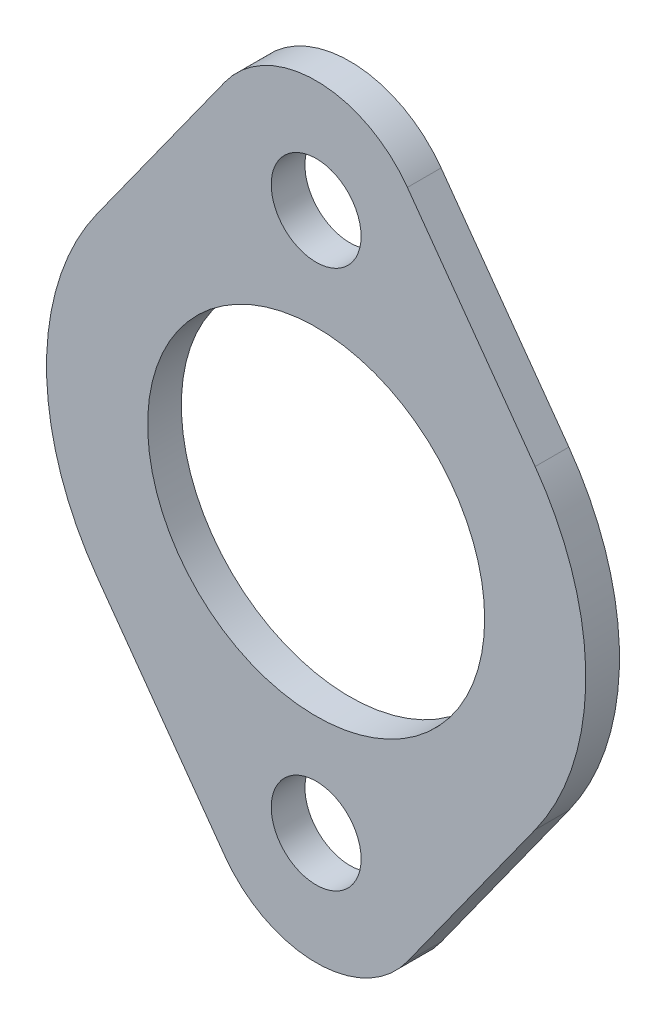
ISO-10303-21;
HEADER;
FILE_DESCRIPTION(('STEP AP214'),'2;1');
FILE_NAME('part.step','',(''),(''),'','','');
FILE_SCHEMA(('AUTOMOTIVE_DESIGN { 1 0 10303 214 1 1 1 1 }'));
ENDSEC;
DATA;
#1=APPLICATION_CONTEXT('core data for automotive mechanical design processes');
#2=APPLICATION_PROTOCOL_DEFINITION('international standard','automotive_design',2000,#1);
#3=PRODUCT_CONTEXT('',#1,'mechanical');
#4=PRODUCT('Part','Part','',(#3));
#5=PRODUCT_RELATED_PRODUCT_CATEGORY('part','',(#4));
#6=PRODUCT_DEFINITION_FORMATION('','',#4);
#7=PRODUCT_DEFINITION_CONTEXT('part definition',#1,'design');
#8=PRODUCT_DEFINITION('design','',#6,#7);
#9=PRODUCT_DEFINITION_SHAPE('','',#8);
#10=(LENGTH_UNIT() NAMED_UNIT(*) SI_UNIT(.MILLI.,.METRE.));
#11=(NAMED_UNIT(*) PLANE_ANGLE_UNIT() SI_UNIT($,.RADIAN.));
#12=(NAMED_UNIT(*) SI_UNIT($,.STERADIAN.) SOLID_ANGLE_UNIT());
#13=UNCERTAINTY_MEASURE_WITH_UNIT(LENGTH_MEASURE(1.E-05),#10,'distance_accuracy_value','');
#14=(GEOMETRIC_REPRESENTATION_CONTEXT(3) GLOBAL_UNCERTAINTY_ASSIGNED_CONTEXT((#13)) GLOBAL_UNIT_ASSIGNED_CONTEXT((#10,
#11,#12)) REPRESENTATION_CONTEXT('',''));
#15=CARTESIAN_POINT('',(0.,0.,0.));
#16=DIRECTION('',(0.,0.,1.));
#17=DIRECTION('',(1.,0.,0.));
#18=AXIS2_PLACEMENT_3D('',#15,#16,#17);
#19=CARTESIAN_POINT('',(0.,38.1,4.7625));
#20=DIRECTION('',(0.,0.,-1.));
#21=DIRECTION('',(-1.,0.,0.));
#22=AXIS2_PLACEMENT_3D('',#19,#20,#21);
#23=CYLINDRICAL_SURFACE('',#22,15.875);
#24=CARTESIAN_POINT('',(0.,38.1,0.));
#25=DIRECTION('',(0.,0.,-1.));
#26=DIRECTION('',(-1.,0.,0.));
#27=AXIS2_PLACEMENT_3D('',#24,#25,#26);
#28=CIRCLE('',#27,15.875);
#29=CARTESIAN_POINT('',(-12.8941966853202,47.3604166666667,0.));
#30=VERTEX_POINT('',#29);
#31=CARTESIAN_POINT('',(12.8941966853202,47.3604166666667,0.));
#32=VERTEX_POINT('',#31);
#33=EDGE_CURVE('E95',#30,#32,#28,.T.);
#34=ORIENTED_EDGE('',*,*,#33,.F.);
#35=DIRECTION('',(0.,0.,-1.));
#36=VECTOR('',#35,1.);
#37=CARTESIAN_POINT('',(-12.8941966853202,47.3604166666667,4.7625));
#38=LINE('',#37,#36);
#39=CARTESIAN_POINT('',(-12.8941966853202,47.3604166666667,4.7625));
#40=VERTEX_POINT('',#39);
#41=EDGE_CURVE('E11',#40,#30,#38,.T.);
#42=ORIENTED_EDGE('',*,*,#41,.F.);
#43=CARTESIAN_POINT('',(0.,38.1,4.7625));
#44=DIRECTION('',(0.,0.,-1.));
#45=DIRECTION('',(-1.,0.,0.));
#46=AXIS2_PLACEMENT_3D('',#43,#44,#45);
#47=CIRCLE('',#46,15.875);
#48=CARTESIAN_POINT('',(12.8941966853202,47.3604166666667,4.7625));
#49=VERTEX_POINT('',#48);
#50=EDGE_CURVE('E96',#40,#49,#47,.T.);
#51=ORIENTED_EDGE('',*,*,#50,.T.);
#52=DIRECTION('',(0.,0.,-1.));
#53=VECTOR('',#52,1.);
#54=CARTESIAN_POINT('',(12.8941966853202,47.3604166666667,4.7625));
#55=LINE('',#54,#53);
#56=EDGE_CURVE('E33',#49,#32,#55,.T.);
#57=ORIENTED_EDGE('',*,*,#56,.T.);
#58=EDGE_LOOP('',(#34,#42,#51,#57));
#59=FACE_BOUND('',#58,.T.);
#60=ADVANCED_FACE('F30',(#59),#23,.T.);
#61=CARTESIAN_POINT('',(-12.8941966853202,47.3604166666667,4.7625));
#62=DIRECTION('',(0.812232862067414,-0.583333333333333,0.));
#63=DIRECTION('',(0.583333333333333,0.812232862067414,0.));
#64=AXIS2_PLACEMENT_3D('',#61,#62,#63);
#65=PLANE('',#64);
#66=DIRECTION('',(-0.583333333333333,-0.812232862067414,0.));
#67=VECTOR('',#66,1.);
#68=CARTESIAN_POINT('',(-12.8941966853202,47.3604166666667,0.));
#69=LINE('',#68,#67);
#70=CARTESIAN_POINT('',(-30.9460720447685,22.225,0.));
#71=VERTEX_POINT('',#70);
#72=EDGE_CURVE('E113',#30,#71,#69,.T.);
#73=ORIENTED_EDGE('',*,*,#72,.T.);
#74=DIRECTION('',(0.,0.,-1.));
#75=VECTOR('',#74,1.);
#76=CARTESIAN_POINT('',(-30.9460720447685,22.225,4.7625));
#77=LINE('',#76,#75);
#78=CARTESIAN_POINT('',(-30.9460720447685,22.225,4.7625));
#79=VERTEX_POINT('',#78);
#80=EDGE_CURVE('E38',#79,#71,#77,.T.);
#81=ORIENTED_EDGE('',*,*,#80,.F.);
#82=DIRECTION('',(-0.583333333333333,-0.812232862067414,0.));
#83=VECTOR('',#82,1.);
#84=CARTESIAN_POINT('',(-12.8941966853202,47.3604166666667,4.7625));
#85=LINE('',#84,#83);
#86=EDGE_CURVE('E51',#40,#79,#85,.T.);
#87=ORIENTED_EDGE('',*,*,#86,.F.);
#88=ORIENTED_EDGE('',*,*,#41,.T.);
#89=EDGE_LOOP('',(#73,#81,#87,#88));
#90=FACE_BOUND('',#89,.T.);
#91=ADVANCED_FACE('F179',(#90),#65,.F.);
#92=CARTESIAN_POINT('',(0.,0.,4.7625));
#93=DIRECTION('',(0.,0.,-1.));
#94=DIRECTION('',(-1.,0.,0.));
#95=AXIS2_PLACEMENT_3D('',#92,#93,#94);
#96=CYLINDRICAL_SURFACE('',#95,38.1);
#97=CARTESIAN_POINT('',(0.,0.,0.));
#98=DIRECTION('',(0.,0.,-1.));
#99=DIRECTION('',(-1.,0.,0.));
#100=AXIS2_PLACEMENT_3D('',#97,#98,#99);
#101=CIRCLE('',#100,38.1);
#102=CARTESIAN_POINT('',(-30.9460720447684,-22.225,0.));
#103=VERTEX_POINT('',#102);
#104=EDGE_CURVE('E130',#103,#71,#101,.T.);
#105=ORIENTED_EDGE('',*,*,#104,.F.);
#106=DIRECTION('',(0.,0.,-1.));
#107=VECTOR('',#106,1.);
#108=CARTESIAN_POINT('',(-30.9460720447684,-22.225,4.7625));
#109=LINE('',#108,#107);
#110=CARTESIAN_POINT('',(-30.9460720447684,-22.225,4.7625));
#111=VERTEX_POINT('',#110);
#112=EDGE_CURVE('E151',#111,#103,#109,.T.);
#113=ORIENTED_EDGE('',*,*,#112,.F.);
#114=CARTESIAN_POINT('',(0.,0.,4.7625));
#115=DIRECTION('',(0.,0.,-1.));
#116=DIRECTION('',(-1.,0.,0.));
#117=AXIS2_PLACEMENT_3D('',#114,#115,#116);
#118=CIRCLE('',#117,38.1);
#119=EDGE_CURVE('E146',#111,#79,#118,.T.);
#120=ORIENTED_EDGE('',*,*,#119,.T.);
#121=ORIENTED_EDGE('',*,*,#80,.T.);
#122=EDGE_LOOP('',(#105,#113,#120,#121));
#123=FACE_BOUND('',#122,.T.);
#124=ADVANCED_FACE('F177',(#123),#96,.T.);
#125=CARTESIAN_POINT('',(-12.8941966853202,-47.3604166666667,4.7625));
#126=DIRECTION('',(-0.812232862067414,-0.583333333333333,0.));
#127=DIRECTION('',(0.583333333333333,-0.812232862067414,0.));
#128=AXIS2_PLACEMENT_3D('',#125,#126,#127);
#129=PLANE('',#128);
#130=DIRECTION('',(-0.583333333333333,0.812232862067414,0.));
#131=VECTOR('',#130,1.);
#132=CARTESIAN_POINT('',(-12.8941966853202,-47.3604166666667,0.));
#133=LINE('',#132,#131);
#134=CARTESIAN_POINT('',(-12.8941966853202,-47.3604166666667,0.));
#135=VERTEX_POINT('',#134);
#136=EDGE_CURVE('E127',#135,#103,#133,.T.);
#137=ORIENTED_EDGE('',*,*,#136,.F.);
#138=DIRECTION('',(0.,0.,-1.));
#139=VECTOR('',#138,1.);
#140=CARTESIAN_POINT('',(-12.8941966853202,-47.3604166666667,4.7625));
#141=LINE('',#140,#139);
#142=CARTESIAN_POINT('',(-12.8941966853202,-47.3604166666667,4.7625));
#143=VERTEX_POINT('',#142);
#144=EDGE_CURVE('E153',#143,#135,#141,.T.);
#145=ORIENTED_EDGE('',*,*,#144,.F.);
#146=DIRECTION('',(-0.583333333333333,0.812232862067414,0.));
#147=VECTOR('',#146,1.);
#148=CARTESIAN_POINT('',(-12.8941966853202,-47.3604166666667,4.7625));
#149=LINE('',#148,#147);
#150=EDGE_CURVE('E143',#143,#111,#149,.T.);
#151=ORIENTED_EDGE('',*,*,#150,.T.);
#152=ORIENTED_EDGE('',*,*,#112,.T.);
#153=EDGE_LOOP('',(#137,#145,#151,#152));
#154=FACE_BOUND('',#153,.T.);
#155=ADVANCED_FACE('F172',(#154),#129,.T.);
#156=CARTESIAN_POINT('',(0.,-38.1,4.7625));
#157=DIRECTION('',(0.,0.,-1.));
#158=DIRECTION('',(-1.,0.,0.));
#159=AXIS2_PLACEMENT_3D('',#156,#157,#158);
#160=CYLINDRICAL_SURFACE('',#159,15.875);
#161=CARTESIAN_POINT('',(0.,-38.1,0.));
#162=DIRECTION('',(0.,0.,1.));
#163=DIRECTION('',(1.,0.,0.));
#164=AXIS2_PLACEMENT_3D('',#161,#162,#163);
#165=CIRCLE('',#164,15.875);
#166=CARTESIAN_POINT('',(12.8941966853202,-47.3604166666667,0.));
#167=VERTEX_POINT('',#166);
#168=EDGE_CURVE('E125',#135,#167,#165,.T.);
#169=ORIENTED_EDGE('',*,*,#168,.T.);
#170=DIRECTION('',(0.,0.,-1.));
#171=VECTOR('',#170,1.);
#172=CARTESIAN_POINT('',(12.8941966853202,-47.3604166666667,4.7625));
#173=LINE('',#172,#171);
#174=CARTESIAN_POINT('',(12.8941966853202,-47.3604166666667,4.7625));
#175=VERTEX_POINT('',#174);
#176=EDGE_CURVE('E155',#175,#167,#173,.T.);
#177=ORIENTED_EDGE('',*,*,#176,.F.);
#178=CARTESIAN_POINT('',(0.,-38.1,4.7625));
#179=DIRECTION('',(0.,0.,1.));
#180=DIRECTION('',(1.,0.,0.));
#181=AXIS2_PLACEMENT_3D('',#178,#179,#180);
#182=CIRCLE('',#181,15.875);
#183=EDGE_CURVE('E141',#143,#175,#182,.T.);
#184=ORIENTED_EDGE('',*,*,#183,.F.);
#185=ORIENTED_EDGE('',*,*,#144,.T.);
#186=EDGE_LOOP('',(#169,#177,#184,#185));
#187=FACE_BOUND('',#186,.T.);
#188=ADVANCED_FACE('F181',(#187),#160,.T.);
#189=CARTESIAN_POINT('',(12.8941966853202,-47.3604166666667,4.7625));
#190=DIRECTION('',(-0.812232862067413,0.583333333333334,0.));
#191=DIRECTION('',(-0.583333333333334,-0.812232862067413,0.));
#192=AXIS2_PLACEMENT_3D('',#189,#190,#191);
#193=PLANE('',#192);
#194=DIRECTION('',(0.583333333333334,0.812232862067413,0.));
#195=VECTOR('',#194,1.);
#196=CARTESIAN_POINT('',(12.8941966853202,-47.3604166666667,0.));
#197=LINE('',#196,#195);
#198=CARTESIAN_POINT('',(30.9460720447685,-22.225,0.));
#199=VERTEX_POINT('',#198);
#200=EDGE_CURVE('E122',#167,#199,#197,.T.);
#201=ORIENTED_EDGE('',*,*,#200,.T.);
#202=DIRECTION('',(0.,0.,-1.));
#203=VECTOR('',#202,1.);
#204=CARTESIAN_POINT('',(30.9460720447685,-22.225,4.7625));
#205=LINE('',#204,#203);
#206=CARTESIAN_POINT('',(30.9460720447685,-22.225,4.7625));
#207=VERTEX_POINT('',#206);
#208=EDGE_CURVE('E158',#207,#199,#205,.T.);
#209=ORIENTED_EDGE('',*,*,#208,.F.);
#210=DIRECTION('',(0.583333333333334,0.812232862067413,0.));
#211=VECTOR('',#210,1.);
#212=CARTESIAN_POINT('',(12.8941966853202,-47.3604166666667,4.7625));
#213=LINE('',#212,#211);
#214=EDGE_CURVE('E139',#175,#207,#213,.T.);
#215=ORIENTED_EDGE('',*,*,#214,.F.);
#216=ORIENTED_EDGE('',*,*,#176,.T.);
#217=EDGE_LOOP('',(#201,#209,#215,#216));
#218=FACE_BOUND('',#217,.T.);
#219=ADVANCED_FACE('F166',(#218),#193,.F.);
#220=CARTESIAN_POINT('',(0.,0.,4.7625));
#221=DIRECTION('',(0.,0.,-1.));
#222=DIRECTION('',(-1.,0.,0.));
#223=AXIS2_PLACEMENT_3D('',#220,#221,#222);
#224=CYLINDRICAL_SURFACE('',#223,38.1);
#225=CARTESIAN_POINT('',(0.,0.,0.));
#226=DIRECTION('',(0.,0.,-1.));
#227=DIRECTION('',(-1.,0.,0.));
#228=AXIS2_PLACEMENT_3D('',#225,#226,#227);
#229=CIRCLE('',#228,38.1);
#230=CARTESIAN_POINT('',(30.9460720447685,22.225,0.));
#231=VERTEX_POINT('',#230);
#232=EDGE_CURVE('E107',#231,#199,#229,.T.);
#233=ORIENTED_EDGE('',*,*,#232,.F.);
#234=DIRECTION('',(0.,0.,-1.));
#235=VECTOR('',#234,1.);
#236=CARTESIAN_POINT('',(30.9460720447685,22.225,4.7625));
#237=LINE('',#236,#235);
#238=CARTESIAN_POINT('',(30.9460720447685,22.225,4.7625));
#239=VERTEX_POINT('',#238);
#240=EDGE_CURVE('E100',#239,#231,#237,.T.);
#241=ORIENTED_EDGE('',*,*,#240,.F.);
#242=CARTESIAN_POINT('',(0.,0.,4.7625));
#243=DIRECTION('',(0.,0.,-1.));
#244=DIRECTION('',(-1.,0.,0.));
#245=AXIS2_PLACEMENT_3D('',#242,#243,#244);
#246=CIRCLE('',#245,38.1);
#247=EDGE_CURVE('E136',#239,#207,#246,.T.);
#248=ORIENTED_EDGE('',*,*,#247,.T.);
#249=ORIENTED_EDGE('',*,*,#208,.T.);
#250=EDGE_LOOP('',(#233,#241,#248,#249));
#251=FACE_BOUND('',#250,.T.);
#252=ADVANCED_FACE('F161',(#251),#224,.T.);
#253=CARTESIAN_POINT('',(12.8941966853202,47.3604166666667,4.7625));
#254=DIRECTION('',(0.812232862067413,0.583333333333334,0.));
#255=DIRECTION('',(-0.583333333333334,0.812232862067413,0.));
#256=AXIS2_PLACEMENT_3D('',#253,#254,#255);
#257=PLANE('',#256);
#258=DIRECTION('',(0.583333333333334,-0.812232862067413,0.));
#259=VECTOR('',#258,1.);
#260=CARTESIAN_POINT('',(12.8941966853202,47.3604166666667,0.));
#261=LINE('',#260,#259);
#262=EDGE_CURVE('E102',#32,#231,#261,.T.);
#263=ORIENTED_EDGE('',*,*,#262,.F.);
#264=ORIENTED_EDGE('',*,*,#56,.F.);
#265=DIRECTION('',(0.583333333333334,-0.812232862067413,0.));
#266=VECTOR('',#265,1.);
#267=CARTESIAN_POINT('',(12.8941966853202,47.3604166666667,4.7625));
#268=LINE('',#267,#266);
#269=EDGE_CURVE('E134',#49,#239,#268,.T.);
#270=ORIENTED_EDGE('',*,*,#269,.T.);
#271=ORIENTED_EDGE('',*,*,#240,.T.);
#272=EDGE_LOOP('',(#263,#264,#270,#271));
#273=FACE_BOUND('',#272,.T.);
#274=ADVANCED_FACE('F103',(#273),#257,.T.);
#275=CARTESIAN_POINT('',(0.,38.1,4.7625));
#276=DIRECTION('',(0.,0.,-1.));
#277=DIRECTION('',(-1.,0.,0.));
#278=AXIS2_PLACEMENT_3D('',#275,#276,#277);
#279=PLANE('',#278);
#280=CARTESIAN_POINT('',(0.,0.,4.7625));
#281=DIRECTION('',(0.,0.,1.));
#282=DIRECTION('',(1.,0.,0.));
#283=AXIS2_PLACEMENT_3D('',#280,#281,#282);
#284=CIRCLE('',#283,23.8125);
#285=CARTESIAN_POINT('',(23.8125,0.,4.7625));
#286=VERTEX_POINT('',#285);
#287=EDGE_CURVE('E225',#286,#286,#284,.T.);
#288=ORIENTED_EDGE('',*,*,#287,.F.);
#289=EDGE_LOOP('',(#288));
#290=FACE_BOUND('',#289,.T.);
#291=CARTESIAN_POINT('',(0.,-38.1,4.7625));
#292=DIRECTION('',(0.,0.,1.));
#293=DIRECTION('',(1.,0.,0.));
#294=AXIS2_PLACEMENT_3D('',#291,#292,#293);
#295=CIRCLE('',#294,6.35);
#296=CARTESIAN_POINT('',(6.35,-38.1,4.7625));
#297=VERTEX_POINT('',#296);
#298=EDGE_CURVE('E227',#297,#297,#295,.T.);
#299=ORIENTED_EDGE('',*,*,#298,.F.);
#300=EDGE_LOOP('',(#299));
#301=FACE_BOUND('',#300,.T.);
#302=CARTESIAN_POINT('',(0.,38.1,4.7625));
#303=DIRECTION('',(0.,0.,1.));
#304=DIRECTION('',(1.,0.,0.));
#305=AXIS2_PLACEMENT_3D('',#302,#303,#304);
#306=CIRCLE('',#305,6.35);
#307=CARTESIAN_POINT('',(6.35,38.1,4.7625));
#308=VERTEX_POINT('',#307);
#309=EDGE_CURVE('E117',#308,#308,#306,.T.);
#310=ORIENTED_EDGE('',*,*,#309,.F.);
#311=EDGE_LOOP('',(#310));
#312=FACE_BOUND('',#311,.T.);
#313=ORIENTED_EDGE('',*,*,#50,.F.);
#314=ORIENTED_EDGE('',*,*,#86,.T.);
#315=ORIENTED_EDGE('',*,*,#119,.F.);
#316=ORIENTED_EDGE('',*,*,#150,.F.);
#317=ORIENTED_EDGE('',*,*,#183,.T.);
#318=ORIENTED_EDGE('',*,*,#214,.T.);
#319=ORIENTED_EDGE('',*,*,#247,.F.);
#320=ORIENTED_EDGE('',*,*,#269,.F.);
#321=EDGE_LOOP('',(#313,#314,#315,#316,#317,#318,#319,#320));
#322=FACE_BOUND('',#321,.T.);
#323=ADVANCED_FACE('F180',(#290,#301,#312,#322),#279,.F.);
#324=CARTESIAN_POINT('',(0.,38.1,0.));
#325=DIRECTION('',(0.,0.,-1.));
#326=DIRECTION('',(-1.,0.,0.));
#327=AXIS2_PLACEMENT_3D('',#324,#325,#326);
#328=PLANE('',#327);
#329=CARTESIAN_POINT('',(0.,0.,0.));
#330=DIRECTION('',(0.,0.,1.));
#331=DIRECTION('',(1.,0.,0.));
#332=AXIS2_PLACEMENT_3D('',#329,#330,#331);
#333=CIRCLE('',#332,23.8125);
#334=CARTESIAN_POINT('',(23.8125,0.,0.));
#335=VERTEX_POINT('',#334);
#336=EDGE_CURVE('E222',#335,#335,#333,.T.);
#337=ORIENTED_EDGE('',*,*,#336,.T.);
#338=EDGE_LOOP('',(#337));
#339=FACE_BOUND('',#338,.T.);
#340=CARTESIAN_POINT('',(0.,-38.1,0.));
#341=DIRECTION('',(0.,0.,1.));
#342=DIRECTION('',(1.,0.,0.));
#343=AXIS2_PLACEMENT_3D('',#340,#341,#342);
#344=CIRCLE('',#343,6.35);
#345=CARTESIAN_POINT('',(6.35,-38.1,0.));
#346=VERTEX_POINT('',#345);
#347=EDGE_CURVE('E232',#346,#346,#344,.T.);
#348=ORIENTED_EDGE('',*,*,#347,.T.);
#349=EDGE_LOOP('',(#348));
#350=FACE_BOUND('',#349,.T.);
#351=CARTESIAN_POINT('',(0.,38.1,0.));
#352=DIRECTION('',(0.,0.,1.));
#353=DIRECTION('',(1.,0.,0.));
#354=AXIS2_PLACEMENT_3D('',#351,#352,#353);
#355=CIRCLE('',#354,6.35);
#356=CARTESIAN_POINT('',(6.35,38.1,0.));
#357=VERTEX_POINT('',#356);
#358=EDGE_CURVE('E114',#357,#357,#355,.T.);
#359=ORIENTED_EDGE('',*,*,#358,.T.);
#360=EDGE_LOOP('',(#359));
#361=FACE_BOUND('',#360,.T.);
#362=ORIENTED_EDGE('',*,*,#33,.T.);
#363=ORIENTED_EDGE('',*,*,#262,.T.);
#364=ORIENTED_EDGE('',*,*,#232,.T.);
#365=ORIENTED_EDGE('',*,*,#200,.F.);
#366=ORIENTED_EDGE('',*,*,#168,.F.);
#367=ORIENTED_EDGE('',*,*,#136,.T.);
#368=ORIENTED_EDGE('',*,*,#104,.T.);
#369=ORIENTED_EDGE('',*,*,#72,.F.);
#370=EDGE_LOOP('',(#362,#363,#364,#365,#366,#367,#368,#369));
#371=FACE_BOUND('',#370,.T.);
#372=ADVANCED_FACE('F110',(#339,#350,#361,#371),#328,.T.);
#373=CARTESIAN_POINT('',(0.,38.1,0.));
#374=DIRECTION('',(0.,0.,1.));
#375=DIRECTION('',(1.,0.,0.));
#376=AXIS2_PLACEMENT_3D('',#373,#374,#375);
#377=CYLINDRICAL_SURFACE('',#376,6.35);
#378=CARTESIAN_POINT('',(6.35,38.1,0.));
#379=CARTESIAN_POINT('',(6.35,38.1,0.049609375));
#380=CARTESIAN_POINT('',(6.35,38.1,0.09921875));
#381=CARTESIAN_POINT('',(6.35,38.1,0.1984375));
#382=CARTESIAN_POINT('',(6.35,38.1,0.248046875));
#383=CARTESIAN_POINT('',(6.35,38.1,0.347265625));
#384=CARTESIAN_POINT('',(6.35,38.1,0.396875));
#385=CARTESIAN_POINT('',(6.35,38.1,0.49609375));
#386=CARTESIAN_POINT('',(6.35,38.1,0.545703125));
#387=CARTESIAN_POINT('',(6.35,38.1,0.644921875));
#388=CARTESIAN_POINT('',(6.35,38.1,0.69453125));
#389=CARTESIAN_POINT('',(6.35,38.1,0.79375));
#390=CARTESIAN_POINT('',(6.35,38.1,0.843359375));
#391=CARTESIAN_POINT('',(6.35,38.1,0.942578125));
#392=CARTESIAN_POINT('',(6.35,38.1,0.9921875));
#393=CARTESIAN_POINT('',(6.35,38.1,1.09140625));
#394=CARTESIAN_POINT('',(6.35,38.1,1.141015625));
#395=CARTESIAN_POINT('',(6.35,38.1,1.240234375));
#396=CARTESIAN_POINT('',(6.35,38.1,1.28984375));
#397=CARTESIAN_POINT('',(6.35,38.1,1.3890625));
#398=CARTESIAN_POINT('',(6.35,38.1,1.438671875));
#399=CARTESIAN_POINT('',(6.35,38.1,1.537890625));
#400=CARTESIAN_POINT('',(6.35,38.1,1.5875));
#401=CARTESIAN_POINT('',(6.35,38.1,1.68671875));
#402=CARTESIAN_POINT('',(6.35,38.1,1.736328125));
#403=CARTESIAN_POINT('',(6.35,38.1,1.835546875));
#404=CARTESIAN_POINT('',(6.35,38.1,1.88515625));
#405=CARTESIAN_POINT('',(6.35,38.1,1.984375));
#406=CARTESIAN_POINT('',(6.35,38.1,2.033984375));
#407=CARTESIAN_POINT('',(6.35,38.1,2.133203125));
#408=CARTESIAN_POINT('',(6.35,38.1,2.1828125));
#409=CARTESIAN_POINT('',(6.35,38.1,2.28203125));
#410=CARTESIAN_POINT('',(6.35,38.1,2.331640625));
#411=CARTESIAN_POINT('',(6.35,38.1,2.430859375));
#412=CARTESIAN_POINT('',(6.35,38.1,2.48046875));
#413=CARTESIAN_POINT('',(6.35,38.1,2.5796875));
#414=CARTESIAN_POINT('',(6.35,38.1,2.629296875));
#415=CARTESIAN_POINT('',(6.35,38.1,2.728515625));
#416=CARTESIAN_POINT('',(6.35,38.1,2.778125));
#417=CARTESIAN_POINT('',(6.35,38.1,2.87734375));
#418=CARTESIAN_POINT('',(6.35,38.1,2.926953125));
#419=CARTESIAN_POINT('',(6.35,38.1,3.026171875));
#420=CARTESIAN_POINT('',(6.35,38.1,3.07578125));
#421=CARTESIAN_POINT('',(6.35,38.1,3.175));
#422=CARTESIAN_POINT('',(6.35,38.1,3.224609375));
#423=CARTESIAN_POINT('',(6.35,38.1,3.323828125));
#424=CARTESIAN_POINT('',(6.35,38.1,3.3734375));
#425=CARTESIAN_POINT('',(6.35,38.1,3.47265625));
#426=CARTESIAN_POINT('',(6.35,38.1,3.522265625));
#427=CARTESIAN_POINT('',(6.35,38.1,3.621484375));
#428=CARTESIAN_POINT('',(6.35,38.1,3.67109375));
#429=CARTESIAN_POINT('',(6.35,38.1,3.7703125));
#430=CARTESIAN_POINT('',(6.35,38.1,3.819921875));
#431=CARTESIAN_POINT('',(6.35,38.1,3.919140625));
#432=CARTESIAN_POINT('',(6.35,38.1,3.96875));
#433=CARTESIAN_POINT('',(6.35,38.1,4.06796875));
#434=CARTESIAN_POINT('',(6.35,38.1,4.117578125));
#435=CARTESIAN_POINT('',(6.35,38.1,4.216796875));
#436=CARTESIAN_POINT('',(6.35,38.1,4.26640625));
#437=CARTESIAN_POINT('',(6.35,38.1,4.365625));
#438=CARTESIAN_POINT('',(6.35,38.1,4.415234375));
#439=CARTESIAN_POINT('',(6.35,38.1,4.514453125));
#440=CARTESIAN_POINT('',(6.35,38.1,4.5640625));
#441=CARTESIAN_POINT('',(6.35,38.1,4.66328125));
#442=CARTESIAN_POINT('',(6.35,38.1,4.712890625));
#443=CARTESIAN_POINT('',(6.35,38.1,4.7625));
#444=B_SPLINE_CURVE_WITH_KNOTS('',3,(#378,#379,#380,#381,#382,#383,#384,#385,#386,#387,#388,
#389,#390,#391,#392,#393,#394,#395,#396,#397,#398,#399,#400,#401,#402,#403,#404,#405,#406,#407,
#408,#409,#410,#411,#412,#413,#414,#415,#416,#417,#418,#419,#420,#421,#422,#423,#424,#425,#426,
#427,#428,#429,#430,#431,#432,#433,#434,#435,#436,#437,#438,#439,#440,#441,#442,#443),
.UNSPECIFIED.,.F.,.F.,(4,2,2,2,2,2,2,2,2,2,2,2,2,2,2,2,2,2,2,2,2,2,2,2,2,2,2,2,2,2,2,2,4),(0.,
0.148828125,0.29765625,0.446484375,0.5953125,0.744140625,0.89296875,1.041796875,1.190625,
1.339453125,1.48828125,1.637109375,1.7859375,1.934765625,2.08359375,2.232421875,2.38125,
2.530078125,2.67890625,2.827734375,2.9765625,3.125390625,3.27421875,3.423046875,3.571875,
3.720703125,3.86953125,4.018359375,4.1671875,4.316015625,4.46484375,4.613671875,4.7625),.UNSPECIFIED.);
#445=EDGE_CURVE('BSEAM205',#357,#308,#444,.T.);
#446=ORIENTED_EDGE('',*,*,#358,.F.);
#447=ORIENTED_EDGE('',*,*,#309,.T.);
#448=ORIENTED_EDGE('',*,*,#445,.T.);
#449=ORIENTED_EDGE('',*,*,#445,.F.);
#450=EDGE_LOOP('',(#446,#448,#447,#449));
#451=FACE_BOUND('',#450,.T.);
#452=ADVANCED_FACE('F205',(#451),#377,.F.);
#453=CARTESIAN_POINT('',(0.,-38.1,0.));
#454=DIRECTION('',(0.,0.,1.));
#455=DIRECTION('',(1.,0.,0.));
#456=AXIS2_PLACEMENT_3D('',#453,#454,#455);
#457=CYLINDRICAL_SURFACE('',#456,6.35);
#458=CARTESIAN_POINT('',(6.35,-38.1,0.));
#459=CARTESIAN_POINT('',(6.35,-38.1,0.049609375));
#460=CARTESIAN_POINT('',(6.35,-38.1,0.09921875));
#461=CARTESIAN_POINT('',(6.35,-38.1,0.1984375));
#462=CARTESIAN_POINT('',(6.35,-38.1,0.248046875));
#463=CARTESIAN_POINT('',(6.35,-38.1,0.347265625));
#464=CARTESIAN_POINT('',(6.35,-38.1,0.396875));
#465=CARTESIAN_POINT('',(6.35,-38.1,0.49609375));
#466=CARTESIAN_POINT('',(6.35,-38.1,0.545703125));
#467=CARTESIAN_POINT('',(6.35,-38.1,0.644921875));
#468=CARTESIAN_POINT('',(6.35,-38.1,0.69453125));
#469=CARTESIAN_POINT('',(6.35,-38.1,0.79375));
#470=CARTESIAN_POINT('',(6.35,-38.1,0.843359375));
#471=CARTESIAN_POINT('',(6.35,-38.1,0.942578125));
#472=CARTESIAN_POINT('',(6.35,-38.1,0.9921875));
#473=CARTESIAN_POINT('',(6.35,-38.1,1.09140625));
#474=CARTESIAN_POINT('',(6.35,-38.1,1.141015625));
#475=CARTESIAN_POINT('',(6.35,-38.1,1.240234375));
#476=CARTESIAN_POINT('',(6.35,-38.1,1.28984375));
#477=CARTESIAN_POINT('',(6.35,-38.1,1.3890625));
#478=CARTESIAN_POINT('',(6.35,-38.1,1.438671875));
#479=CARTESIAN_POINT('',(6.35,-38.1,1.537890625));
#480=CARTESIAN_POINT('',(6.35,-38.1,1.5875));
#481=CARTESIAN_POINT('',(6.35,-38.1,1.68671875));
#482=CARTESIAN_POINT('',(6.35,-38.1,1.736328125));
#483=CARTESIAN_POINT('',(6.35,-38.1,1.835546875));
#484=CARTESIAN_POINT('',(6.35,-38.1,1.88515625));
#485=CARTESIAN_POINT('',(6.35,-38.1,1.984375));
#486=CARTESIAN_POINT('',(6.35,-38.1,2.033984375));
#487=CARTESIAN_POINT('',(6.35,-38.1,2.133203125));
#488=CARTESIAN_POINT('',(6.35,-38.1,2.1828125));
#489=CARTESIAN_POINT('',(6.35,-38.1,2.28203125));
#490=CARTESIAN_POINT('',(6.35,-38.1,2.331640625));
#491=CARTESIAN_POINT('',(6.35,-38.1,2.430859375));
#492=CARTESIAN_POINT('',(6.35,-38.1,2.48046875));
#493=CARTESIAN_POINT('',(6.35,-38.1,2.5796875));
#494=CARTESIAN_POINT('',(6.35,-38.1,2.629296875));
#495=CARTESIAN_POINT('',(6.35,-38.1,2.728515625));
#496=CARTESIAN_POINT('',(6.35,-38.1,2.778125));
#497=CARTESIAN_POINT('',(6.35,-38.1,2.87734375));
#498=CARTESIAN_POINT('',(6.35,-38.1,2.926953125));
#499=CARTESIAN_POINT('',(6.35,-38.1,3.026171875));
#500=CARTESIAN_POINT('',(6.35,-38.1,3.07578125));
#501=CARTESIAN_POINT('',(6.35,-38.1,3.175));
#502=CARTESIAN_POINT('',(6.35,-38.1,3.224609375));
#503=CARTESIAN_POINT('',(6.35,-38.1,3.323828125));
#504=CARTESIAN_POINT('',(6.35,-38.1,3.3734375));
#505=CARTESIAN_POINT('',(6.35,-38.1,3.47265625));
#506=CARTESIAN_POINT('',(6.35,-38.1,3.522265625));
#507=CARTESIAN_POINT('',(6.35,-38.1,3.621484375));
#508=CARTESIAN_POINT('',(6.35,-38.1,3.67109375));
#509=CARTESIAN_POINT('',(6.35,-38.1,3.7703125));
#510=CARTESIAN_POINT('',(6.35,-38.1,3.819921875));
#511=CARTESIAN_POINT('',(6.35,-38.1,3.919140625));
#512=CARTESIAN_POINT('',(6.35,-38.1,3.96875));
#513=CARTESIAN_POINT('',(6.35,-38.1,4.06796875));
#514=CARTESIAN_POINT('',(6.35,-38.1,4.117578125));
#515=CARTESIAN_POINT('',(6.35,-38.1,4.216796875));
#516=CARTESIAN_POINT('',(6.35,-38.1,4.26640625));
#517=CARTESIAN_POINT('',(6.35,-38.1,4.365625));
#518=CARTESIAN_POINT('',(6.35,-38.1,4.415234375));
#519=CARTESIAN_POINT('',(6.35,-38.1,4.514453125));
#520=CARTESIAN_POINT('',(6.35,-38.1,4.5640625));
#521=CARTESIAN_POINT('',(6.35,-38.1,4.66328125));
#522=CARTESIAN_POINT('',(6.35,-38.1,4.712890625));
#523=CARTESIAN_POINT('',(6.35,-38.1,4.7625));
#524=B_SPLINE_CURVE_WITH_KNOTS('',3,(#458,#459,#460,#461,#462,#463,#464,#465,#466,#467,#468,
#469,#470,#471,#472,#473,#474,#475,#476,#477,#478,#479,#480,#481,#482,#483,#484,#485,#486,#487,
#488,#489,#490,#491,#492,#493,#494,#495,#496,#497,#498,#499,#500,#501,#502,#503,#504,#505,#506,
#507,#508,#509,#510,#511,#512,#513,#514,#515,#516,#517,#518,#519,#520,#521,#522,#523),
.UNSPECIFIED.,.F.,.F.,(4,2,2,2,2,2,2,2,2,2,2,2,2,2,2,2,2,2,2,2,2,2,2,2,2,2,2,2,2,2,2,2,4),(0.,
0.148828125,0.29765625,0.446484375,0.5953125,0.744140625,0.89296875,1.041796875,1.190625,
1.339453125,1.48828125,1.637109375,1.7859375,1.934765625,2.08359375,2.232421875,2.38125,
2.530078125,2.67890625,2.827734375,2.9765625,3.125390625,3.27421875,3.423046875,3.571875,
3.720703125,3.86953125,4.018359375,4.1671875,4.316015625,4.46484375,4.613671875,4.7625),.UNSPECIFIED.);
#525=EDGE_CURVE('BSEAM209',#346,#297,#524,.T.);
#526=ORIENTED_EDGE('',*,*,#347,.F.);
#527=ORIENTED_EDGE('',*,*,#298,.T.);
#528=ORIENTED_EDGE('',*,*,#525,.T.);
#529=ORIENTED_EDGE('',*,*,#525,.F.);
#530=EDGE_LOOP('',(#526,#528,#527,#529));
#531=FACE_BOUND('',#530,.T.);
#532=ADVANCED_FACE('F209',(#531),#457,.F.);
#533=CARTESIAN_POINT('',(0.,0.,0.));
#534=DIRECTION('',(0.,0.,1.));
#535=DIRECTION('',(1.,0.,0.));
#536=AXIS2_PLACEMENT_3D('',#533,#534,#535);
#537=CYLINDRICAL_SURFACE('',#536,23.8125);
#538=CARTESIAN_POINT('',(23.8125,0.,0.));
#539=CARTESIAN_POINT('',(23.8125,0.,0.049609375));
#540=CARTESIAN_POINT('',(23.8125,0.,0.09921875));
#541=CARTESIAN_POINT('',(23.8125,0.,0.1984375));
#542=CARTESIAN_POINT('',(23.8125,0.,0.248046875));
#543=CARTESIAN_POINT('',(23.8125,0.,0.347265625));
#544=CARTESIAN_POINT('',(23.8125,0.,0.396875));
#545=CARTESIAN_POINT('',(23.8125,0.,0.49609375));
#546=CARTESIAN_POINT('',(23.8125,0.,0.545703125));
#547=CARTESIAN_POINT('',(23.8125,0.,0.644921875));
#548=CARTESIAN_POINT('',(23.8125,0.,0.69453125));
#549=CARTESIAN_POINT('',(23.8125,0.,0.79375));
#550=CARTESIAN_POINT('',(23.8125,0.,0.843359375));
#551=CARTESIAN_POINT('',(23.8125,0.,0.942578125));
#552=CARTESIAN_POINT('',(23.8125,0.,0.9921875));
#553=CARTESIAN_POINT('',(23.8125,0.,1.09140625));
#554=CARTESIAN_POINT('',(23.8125,0.,1.141015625));
#555=CARTESIAN_POINT('',(23.8125,0.,1.240234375));
#556=CARTESIAN_POINT('',(23.8125,0.,1.28984375));
#557=CARTESIAN_POINT('',(23.8125,0.,1.3890625));
#558=CARTESIAN_POINT('',(23.8125,0.,1.438671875));
#559=CARTESIAN_POINT('',(23.8125,0.,1.537890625));
#560=CARTESIAN_POINT('',(23.8125,0.,1.5875));
#561=CARTESIAN_POINT('',(23.8125,0.,1.68671875));
#562=CARTESIAN_POINT('',(23.8125,0.,1.736328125));
#563=CARTESIAN_POINT('',(23.8125,0.,1.835546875));
#564=CARTESIAN_POINT('',(23.8125,0.,1.88515625));
#565=CARTESIAN_POINT('',(23.8125,0.,1.984375));
#566=CARTESIAN_POINT('',(23.8125,0.,2.033984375));
#567=CARTESIAN_POINT('',(23.8125,0.,2.133203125));
#568=CARTESIAN_POINT('',(23.8125,0.,2.1828125));
#569=CARTESIAN_POINT('',(23.8125,0.,2.28203125));
#570=CARTESIAN_POINT('',(23.8125,0.,2.331640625));
#571=CARTESIAN_POINT('',(23.8125,0.,2.430859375));
#572=CARTESIAN_POINT('',(23.8125,0.,2.48046875));
#573=CARTESIAN_POINT('',(23.8125,0.,2.5796875));
#574=CARTESIAN_POINT('',(23.8125,0.,2.629296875));
#575=CARTESIAN_POINT('',(23.8125,0.,2.728515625));
#576=CARTESIAN_POINT('',(23.8125,0.,2.778125));
#577=CARTESIAN_POINT('',(23.8125,0.,2.87734375));
#578=CARTESIAN_POINT('',(23.8125,0.,2.926953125));
#579=CARTESIAN_POINT('',(23.8125,0.,3.026171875));
#580=CARTESIAN_POINT('',(23.8125,0.,3.07578125));
#581=CARTESIAN_POINT('',(23.8125,0.,3.175));
#582=CARTESIAN_POINT('',(23.8125,0.,3.224609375));
#583=CARTESIAN_POINT('',(23.8125,0.,3.323828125));
#584=CARTESIAN_POINT('',(23.8125,0.,3.3734375));
#585=CARTESIAN_POINT('',(23.8125,0.,3.47265625));
#586=CARTESIAN_POINT('',(23.8125,0.,3.522265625));
#587=CARTESIAN_POINT('',(23.8125,0.,3.621484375));
#588=CARTESIAN_POINT('',(23.8125,0.,3.67109375));
#589=CARTESIAN_POINT('',(23.8125,0.,3.7703125));
#590=CARTESIAN_POINT('',(23.8125,0.,3.819921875));
#591=CARTESIAN_POINT('',(23.8125,0.,3.919140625));
#592=CARTESIAN_POINT('',(23.8125,0.,3.96875));
#593=CARTESIAN_POINT('',(23.8125,0.,4.06796875));
#594=CARTESIAN_POINT('',(23.8125,0.,4.117578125));
#595=CARTESIAN_POINT('',(23.8125,0.,4.216796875));
#596=CARTESIAN_POINT('',(23.8125,0.,4.26640625));
#597=CARTESIAN_POINT('',(23.8125,0.,4.365625));
#598=CARTESIAN_POINT('',(23.8125,0.,4.415234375));
#599=CARTESIAN_POINT('',(23.8125,0.,4.514453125));
#600=CARTESIAN_POINT('',(23.8125,0.,4.5640625));
#601=CARTESIAN_POINT('',(23.8125,0.,4.66328125));
#602=CARTESIAN_POINT('',(23.8125,0.,4.712890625));
#603=CARTESIAN_POINT('',(23.8125,0.,4.7625));
#604=B_SPLINE_CURVE_WITH_KNOTS('',3,(#538,#539,#540,#541,#542,#543,#544,#545,#546,#547,#548,
#549,#550,#551,#552,#553,#554,#555,#556,#557,#558,#559,#560,#561,#562,#563,#564,#565,#566,#567,
#568,#569,#570,#571,#572,#573,#574,#575,#576,#577,#578,#579,#580,#581,#582,#583,#584,#585,#586,
#587,#588,#589,#590,#591,#592,#593,#594,#595,#596,#597,#598,#599,#600,#601,#602,#603),
.UNSPECIFIED.,.F.,.F.,(4,2,2,2,2,2,2,2,2,2,2,2,2,2,2,2,2,2,2,2,2,2,2,2,2,2,2,2,2,2,2,2,4),(0.,
0.148828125,0.29765625,0.446484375,0.5953125,0.744140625,0.89296875,1.041796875,1.190625,
1.339453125,1.48828125,1.637109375,1.7859375,1.934765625,2.08359375,2.232421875,2.38125,
2.530078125,2.67890625,2.827734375,2.9765625,3.125390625,3.27421875,3.423046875,3.571875,
3.720703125,3.86953125,4.018359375,4.1671875,4.316015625,4.46484375,4.613671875,4.7625),.UNSPECIFIED.);
#605=EDGE_CURVE('BSEAM213',#335,#286,#604,.T.);
#606=ORIENTED_EDGE('',*,*,#336,.F.);
#607=ORIENTED_EDGE('',*,*,#287,.T.);
#608=ORIENTED_EDGE('',*,*,#605,.T.);
#609=ORIENTED_EDGE('',*,*,#605,.F.);
#610=EDGE_LOOP('',(#606,#608,#607,#609));
#611=FACE_BOUND('',#610,.T.);
#612=ADVANCED_FACE('F213',(#611),#537,.F.);
#613=CLOSED_SHELL('',(#60,#91,#124,#155,#188,#219,#252,#274,#323,#372,#452,#532,#612));
#614=MANIFOLD_SOLID_BREP('B2',#613);
#615=ADVANCED_BREP_SHAPE_REPRESENTATION('',(#18,#614),#14);
#616=SHAPE_DEFINITION_REPRESENTATION(#9,#615);
ENDSEC;
END-ISO-10303-21;
